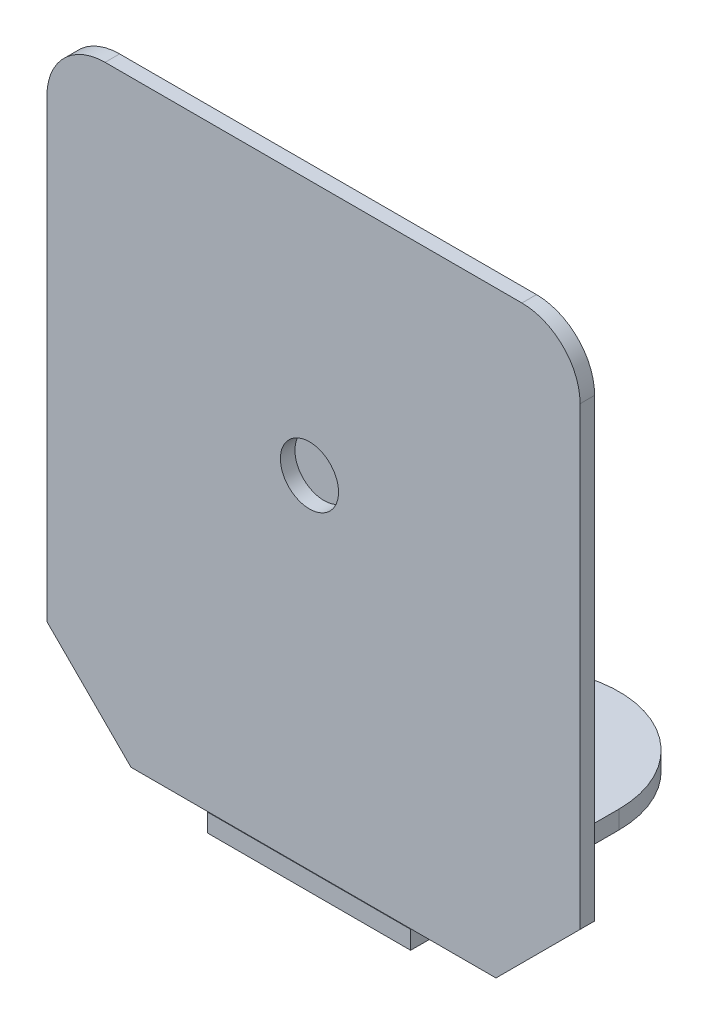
ISO-10303-21;
HEADER;
FILE_DESCRIPTION(('STEP AP214'),'2;1');
FILE_NAME('part.step','',(''),(''),'','','');
FILE_SCHEMA(('AUTOMOTIVE_DESIGN { 1 0 10303 214 1 1 1 1 }'));
ENDSEC;
DATA;
#1=APPLICATION_CONTEXT('core data for automotive mechanical design processes');
#2=APPLICATION_PROTOCOL_DEFINITION('international standard','automotive_design',2000,#1);
#3=PRODUCT_CONTEXT('',#1,'mechanical');
#4=PRODUCT('Part','Part','',(#3));
#5=PRODUCT_RELATED_PRODUCT_CATEGORY('part','',(#4));
#6=PRODUCT_DEFINITION_FORMATION('','',#4);
#7=PRODUCT_DEFINITION_CONTEXT('part definition',#1,'design');
#8=PRODUCT_DEFINITION('design','',#6,#7);
#9=PRODUCT_DEFINITION_SHAPE('','',#8);
#10=(LENGTH_UNIT() NAMED_UNIT(*) SI_UNIT(.MILLI.,.METRE.));
#11=(NAMED_UNIT(*) PLANE_ANGLE_UNIT() SI_UNIT($,.RADIAN.));
#12=(NAMED_UNIT(*) SI_UNIT($,.STERADIAN.) SOLID_ANGLE_UNIT());
#13=UNCERTAINTY_MEASURE_WITH_UNIT(LENGTH_MEASURE(1.E-05),#10,'distance_accuracy_value','');
#14=(GEOMETRIC_REPRESENTATION_CONTEXT(3) GLOBAL_UNCERTAINTY_ASSIGNED_CONTEXT((#13)) GLOBAL_UNIT_ASSIGNED_CONTEXT((#10,
#11,#12)) REPRESENTATION_CONTEXT('',''));
#15=CARTESIAN_POINT('',(0.,0.,0.));
#16=DIRECTION('',(0.,0.,1.));
#17=DIRECTION('',(1.,0.,0.));
#18=AXIS2_PLACEMENT_3D('',#15,#16,#17);
#19=CARTESIAN_POINT('',(3.34575114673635,5.7,0.));
#20=DIRECTION('',(0.,0.,-1.));
#21=DIRECTION('',(-1.,0.,0.));
#22=AXIS2_PLACEMENT_3D('',#19,#20,#21);
#23=PLANE('',#22);
#24=DIRECTION('',(1.,0.,0.));
#25=VECTOR('',#24,1.);
#26=CARTESIAN_POINT('',(8.72284317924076,-1.71953510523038,0.));
#27=LINE('',#26,#25);
#28=CARTESIAN_POINT('',(3.70275192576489,-1.71953510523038,0.));
#29=VERTEX_POINT('',#28);
#30=CARTESIAN_POINT('',(4.75844340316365,-1.71953510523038,0.));
#31=VERTEX_POINT('',#30);
#32=EDGE_CURVE('E186',#29,#31,#27,.T.);
#33=ORIENTED_EDGE('',*,*,#32,.F.);
#34=DIRECTION('',(0.707106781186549,-0.707106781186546,0.));
#35=VECTOR('',#34,1.);
#36=CARTESIAN_POINT('',(3.70275192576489,-1.71953510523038,0.));
#37=LINE('',#36,#35);
#38=CARTESIAN_POINT('',(2.54575114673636,-0.562534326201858,0.));
#39=VERTEX_POINT('',#38);
#40=EDGE_CURVE('E201',#39,#29,#37,.T.);
#41=ORIENTED_EDGE('',*,*,#40,.F.);
#42=DIRECTION('',(0.,-1.,0.));
#43=VECTOR('',#42,1.);
#44=CARTESIAN_POINT('',(2.54575114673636,-0.562534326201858,0.));
#45=LINE('',#44,#43);
#46=CARTESIAN_POINT('',(2.54575114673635,5.69999999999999,0.));
#47=VERTEX_POINT('',#46);
#48=EDGE_CURVE('E199',#47,#39,#45,.T.);
#49=ORIENTED_EDGE('',*,*,#48,.F.);
#50=CARTESIAN_POINT('',(3.34575114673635,5.7,0.));
#51=DIRECTION('',(0.,0.,1.));
#52=DIRECTION('',(-1.,0.,0.));
#53=AXIS2_PLACEMENT_3D('',#50,#51,#52);
#54=CIRCLE('',#53,0.8);
#55=CARTESIAN_POINT('',(3.34575114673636,6.5,0.));
#56=VERTEX_POINT('',#55);
#57=EDGE_CURVE('E196',#56,#47,#54,.T.);
#58=ORIENTED_EDGE('',*,*,#57,.F.);
#59=DIRECTION('',(-1.,0.,0.));
#60=VECTOR('',#59,1.);
#61=CARTESIAN_POINT('',(9.07984395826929,6.5,0.));
#62=LINE('',#61,#60);
#63=CARTESIAN_POINT('',(9.07984395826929,6.5,0.));
#64=VERTEX_POINT('',#63);
#65=EDGE_CURVE('E194',#64,#56,#62,.T.);
#66=ORIENTED_EDGE('',*,*,#65,.F.);
#67=CARTESIAN_POINT('',(9.07984395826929,5.7,0.));
#68=DIRECTION('',(0.,0.,1.));
#69=DIRECTION('',(1.,0.,0.));
#70=AXIS2_PLACEMENT_3D('',#67,#68,#69);
#71=CIRCLE('',#70,0.800000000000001);
#72=CARTESIAN_POINT('',(9.87984395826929,5.7,0.));
#73=VERTEX_POINT('',#72);
#74=EDGE_CURVE('E192',#73,#64,#71,.T.);
#75=ORIENTED_EDGE('',*,*,#74,.F.);
#76=DIRECTION('',(0.,1.,0.));
#77=VECTOR('',#76,1.);
#78=CARTESIAN_POINT('',(9.87984395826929,-0.562534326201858,0.));
#79=LINE('',#78,#77);
#80=CARTESIAN_POINT('',(9.87984395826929,-0.562534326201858,0.));
#81=VERTEX_POINT('',#80);
#82=EDGE_CURVE('E190',#81,#73,#79,.T.);
#83=ORIENTED_EDGE('',*,*,#82,.F.);
#84=DIRECTION('',(0.707106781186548,0.707106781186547,0.));
#85=VECTOR('',#84,1.);
#86=CARTESIAN_POINT('',(9.87984395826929,-0.562534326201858,0.));
#87=LINE('',#86,#85);
#88=CARTESIAN_POINT('',(8.72284317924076,-1.71953510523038,0.));
#89=VERTEX_POINT('',#88);
#90=EDGE_CURVE('E188',#89,#81,#87,.T.);
#91=ORIENTED_EDGE('',*,*,#90,.F.);
#92=CARTESIAN_POINT('',(7.55616000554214,-1.71953510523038,0.));
#93=VERTEX_POINT('',#92);
#94=EDGE_CURVE('E185',#93,#89,#27,.T.);
#95=ORIENTED_EDGE('',*,*,#94,.F.);
#96=EDGE_CURVE('E138',#31,#93,#27,.T.);
#97=ORIENTED_EDGE('',*,*,#96,.F.);
#98=EDGE_LOOP('',(#33,#41,#49,#58,#66,#75,#83,#91,#95,#97));
#99=FACE_BOUND('',#98,.T.);
#100=CARTESIAN_POINT('',(6.1948880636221,3.0084637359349,0.));
#101=DIRECTION('',(0.,0.,-1.));
#102=DIRECTION('',(-1.,0.,0.));
#103=AXIS2_PLACEMENT_3D('',#100,#101,#102);
#104=CIRCLE('',#103,1.72898469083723);
#105=CARTESIAN_POINT('',(4.46590337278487,3.0084637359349,0.));
#106=VERTEX_POINT('',#105);
#107=EDGE_CURVE('E161',#106,#106,#104,.T.);
#108=ORIENTED_EDGE('',*,*,#107,.F.);
#109=EDGE_LOOP('',(#108));
#110=FACE_BOUND('',#109,.T.);
#111=ADVANCED_FACE('F26',(#99,#110),#23,.T.);
#112=CARTESIAN_POINT('',(8.72284317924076,-1.71953510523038,0.2));
#113=DIRECTION('',(0.,1.,0.));
#114=DIRECTION('',(-1.,0.,0.));
#115=AXIS2_PLACEMENT_3D('',#112,#113,#114);
#116=PLANE('',#115);
#117=DIRECTION('',(0.,0.,-1.));
#118=VECTOR('',#117,1.);
#119=CARTESIAN_POINT('',(4.75844340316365,-1.71953510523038,0.207047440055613));
#120=LINE('',#119,#118);
#121=CARTESIAN_POINT('',(4.75844340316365,-1.71953510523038,0.2));
#122=VERTEX_POINT('',#121);
#123=EDGE_CURVE('E11',#122,#31,#120,.T.);
#124=ORIENTED_EDGE('',*,*,#123,.F.);
#125=DIRECTION('',(1.,0.,0.));
#126=VECTOR('',#125,1.);
#127=CARTESIAN_POINT('',(8.72284317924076,-1.71953510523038,0.2));
#128=LINE('',#127,#126);
#129=CARTESIAN_POINT('',(3.70275192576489,-1.71953510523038,0.2));
#130=VERTEX_POINT('',#129);
#131=EDGE_CURVE('E204',#130,#122,#128,.T.);
#132=ORIENTED_EDGE('',*,*,#131,.F.);
#133=DIRECTION('',(0.,0.,-1.));
#134=VECTOR('',#133,1.);
#135=CARTESIAN_POINT('',(3.70275192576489,-1.71953510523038,0.2));
#136=LINE('',#135,#134);
#137=EDGE_CURVE('E221',#130,#29,#136,.T.);
#138=ORIENTED_EDGE('',*,*,#137,.T.);
#139=ORIENTED_EDGE('',*,*,#32,.T.);
#140=EDGE_LOOP('',(#124,#132,#138,#139));
#141=FACE_BOUND('',#140,.T.);
#142=ADVANCED_FACE('F28',(#141),#116,.F.);
#143=DIRECTION('',(0.,0.,1.));
#144=VECTOR('',#143,1.);
#145=CARTESIAN_POINT('',(7.55616000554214,-1.71953510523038,0.207047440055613));
#146=LINE('',#145,#144);
#147=CARTESIAN_POINT('',(7.55616000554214,-1.71953510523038,0.2));
#148=VERTEX_POINT('',#147);
#149=EDGE_CURVE('E35',#93,#148,#146,.T.);
#150=ORIENTED_EDGE('',*,*,#149,.F.);
#151=ORIENTED_EDGE('',*,*,#94,.T.);
#152=DIRECTION('',(0.,0.,-1.));
#153=VECTOR('',#152,1.);
#154=CARTESIAN_POINT('',(8.72284317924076,-1.71953510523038,0.2));
#155=LINE('',#154,#153);
#156=CARTESIAN_POINT('',(8.72284317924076,-1.71953510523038,0.2));
#157=VERTEX_POINT('',#156);
#158=EDGE_CURVE('E30',#157,#89,#155,.T.);
#159=ORIENTED_EDGE('',*,*,#158,.F.);
#160=EDGE_CURVE('E203',#148,#157,#128,.T.);
#161=ORIENTED_EDGE('',*,*,#160,.F.);
#162=EDGE_LOOP('',(#150,#151,#159,#161));
#163=FACE_BOUND('',#162,.T.);
#164=ADVANCED_FACE('F279',(#163),#116,.F.);
#165=CARTESIAN_POINT('',(3.34575114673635,5.7,0.2));
#166=DIRECTION('',(0.,0.,-1.));
#167=DIRECTION('',(-1.,0.,0.));
#168=AXIS2_PLACEMENT_3D('',#165,#166,#167);
#169=PLANE('',#168);
#170=ORIENTED_EDGE('',*,*,#131,.T.);
#171=EDGE_CURVE('E207',#122,#148,#128,.T.);
#172=ORIENTED_EDGE('',*,*,#171,.T.);
#173=ORIENTED_EDGE('',*,*,#160,.T.);
#174=DIRECTION('',(0.707106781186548,0.707106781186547,0.));
#175=VECTOR('',#174,1.);
#176=CARTESIAN_POINT('',(9.87984395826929,-0.562534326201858,0.2));
#177=LINE('',#176,#175);
#178=CARTESIAN_POINT('',(9.87984395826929,-0.562534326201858,0.2));
#179=VERTEX_POINT('',#178);
#180=EDGE_CURVE('E206',#157,#179,#177,.T.);
#181=ORIENTED_EDGE('',*,*,#180,.T.);
#182=DIRECTION('',(0.,1.,0.));
#183=VECTOR('',#182,1.);
#184=CARTESIAN_POINT('',(9.87984395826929,-0.562534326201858,0.2));
#185=LINE('',#184,#183);
#186=CARTESIAN_POINT('',(9.87984395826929,5.7,0.2));
#187=VERTEX_POINT('',#186);
#188=EDGE_CURVE('E209',#179,#187,#185,.T.);
#189=ORIENTED_EDGE('',*,*,#188,.T.);
#190=CARTESIAN_POINT('',(9.07984395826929,5.7,0.2));
#191=DIRECTION('',(0.,0.,1.));
#192=DIRECTION('',(1.,0.,0.));
#193=AXIS2_PLACEMENT_3D('',#190,#191,#192);
#194=CIRCLE('',#193,0.800000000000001);
#195=CARTESIAN_POINT('',(9.07984395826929,6.5,0.2));
#196=VERTEX_POINT('',#195);
#197=EDGE_CURVE('E211',#187,#196,#194,.T.);
#198=ORIENTED_EDGE('',*,*,#197,.T.);
#199=DIRECTION('',(-1.,0.,0.));
#200=VECTOR('',#199,1.);
#201=CARTESIAN_POINT('',(9.07984395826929,6.5,0.2));
#202=LINE('',#201,#200);
#203=CARTESIAN_POINT('',(3.34575114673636,6.5,0.2));
#204=VERTEX_POINT('',#203);
#205=EDGE_CURVE('E213',#196,#204,#202,.T.);
#206=ORIENTED_EDGE('',*,*,#205,.T.);
#207=CARTESIAN_POINT('',(3.34575114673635,5.7,0.2));
#208=DIRECTION('',(0.,0.,1.));
#209=DIRECTION('',(-1.,0.,0.));
#210=AXIS2_PLACEMENT_3D('',#207,#208,#209);
#211=CIRCLE('',#210,0.8);
#212=CARTESIAN_POINT('',(2.54575114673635,5.69999999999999,0.2));
#213=VERTEX_POINT('',#212);
#214=EDGE_CURVE('E215',#204,#213,#211,.T.);
#215=ORIENTED_EDGE('',*,*,#214,.T.);
#216=DIRECTION('',(0.,-1.,0.));
#217=VECTOR('',#216,1.);
#218=CARTESIAN_POINT('',(2.54575114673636,0.,0.2));
#219=LINE('',#218,#217);
#220=CARTESIAN_POINT('',(2.54575114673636,-0.562534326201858,0.2));
#221=VERTEX_POINT('',#220);
#222=EDGE_CURVE('E217',#213,#221,#219,.T.);
#223=ORIENTED_EDGE('',*,*,#222,.T.);
#224=DIRECTION('',(0.707106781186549,-0.707106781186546,0.));
#225=VECTOR('',#224,1.);
#226=CARTESIAN_POINT('',(3.70275192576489,-1.71953510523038,0.2));
#227=LINE('',#226,#225);
#228=EDGE_CURVE('E219',#221,#130,#227,.T.);
#229=ORIENTED_EDGE('',*,*,#228,.T.);
#230=EDGE_LOOP('',(#170,#172,#173,#181,#189,#198,#206,#215,#223,#229));
#231=FACE_BOUND('',#230,.T.);
#232=CARTESIAN_POINT('',(6.1573017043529,2.98516921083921,0.2));
#233=DIRECTION('',(0.,0.,1.));
#234=DIRECTION('',(1.,0.,0.));
#235=AXIS2_PLACEMENT_3D('',#232,#233,#234);
#236=CIRCLE('',#235,0.400000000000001);
#237=CARTESIAN_POINT('',(6.5573017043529,2.98516921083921,0.2));
#238=VERTEX_POINT('',#237);
#239=EDGE_CURVE('E182',#238,#238,#236,.T.);
#240=ORIENTED_EDGE('',*,*,#239,.F.);
#241=EDGE_LOOP('',(#240));
#242=FACE_BOUND('',#241,.T.);
#243=ADVANCED_FACE('F286',(#231,#242),#169,.F.);
#244=CARTESIAN_POINT('',(9.87984395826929,-0.562534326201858,0.2));
#245=DIRECTION('',(-0.707106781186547,0.707106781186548,0.));
#246=DIRECTION('',(-0.707106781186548,-0.707106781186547,0.));
#247=AXIS2_PLACEMENT_3D('',#244,#245,#246);
#248=PLANE('',#247);
#249=ORIENTED_EDGE('',*,*,#90,.T.);
#250=DIRECTION('',(0.,0.,-1.));
#251=VECTOR('',#250,1.);
#252=CARTESIAN_POINT('',(9.87984395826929,-0.562534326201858,0.2));
#253=LINE('',#252,#251);
#254=EDGE_CURVE('E238',#179,#81,#253,.T.);
#255=ORIENTED_EDGE('',*,*,#254,.F.);
#256=ORIENTED_EDGE('',*,*,#180,.F.);
#257=ORIENTED_EDGE('',*,*,#158,.T.);
#258=EDGE_LOOP('',(#249,#255,#256,#257));
#259=FACE_BOUND('',#258,.T.);
#260=ADVANCED_FACE('F289',(#259),#248,.F.);
#261=CARTESIAN_POINT('',(9.87984395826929,-0.562534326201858,0.2));
#262=DIRECTION('',(-1.,0.,0.));
#263=DIRECTION('',(0.,-1.,0.));
#264=AXIS2_PLACEMENT_3D('',#261,#262,#263);
#265=PLANE('',#264);
#266=ORIENTED_EDGE('',*,*,#82,.T.);
#267=DIRECTION('',(0.,0.,-1.));
#268=VECTOR('',#267,1.);
#269=CARTESIAN_POINT('',(9.87984395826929,5.7,0.2));
#270=LINE('',#269,#268);
#271=EDGE_CURVE('E236',#187,#73,#270,.T.);
#272=ORIENTED_EDGE('',*,*,#271,.F.);
#273=ORIENTED_EDGE('',*,*,#188,.F.);
#274=ORIENTED_EDGE('',*,*,#254,.T.);
#275=EDGE_LOOP('',(#266,#272,#273,#274));
#276=FACE_BOUND('',#275,.T.);
#277=ADVANCED_FACE('F310',(#276),#265,.F.);
#278=CARTESIAN_POINT('',(9.07984395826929,5.7,0.2));
#279=DIRECTION('',(0.,0.,-1.));
#280=DIRECTION('',(-1.,0.,0.));
#281=AXIS2_PLACEMENT_3D('',#278,#279,#280);
#282=CYLINDRICAL_SURFACE('',#281,0.800000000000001);
#283=ORIENTED_EDGE('',*,*,#74,.T.);
#284=DIRECTION('',(0.,0.,-1.));
#285=VECTOR('',#284,1.);
#286=CARTESIAN_POINT('',(9.07984395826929,6.5,0.2));
#287=LINE('',#286,#285);
#288=EDGE_CURVE('E233',#196,#64,#287,.T.);
#289=ORIENTED_EDGE('',*,*,#288,.F.);
#290=ORIENTED_EDGE('',*,*,#197,.F.);
#291=ORIENTED_EDGE('',*,*,#271,.T.);
#292=EDGE_LOOP('',(#283,#289,#290,#291));
#293=FACE_BOUND('',#292,.T.);
#294=ADVANCED_FACE('F306',(#293),#282,.T.);
#295=CARTESIAN_POINT('',(9.07984395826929,6.5,0.2));
#296=DIRECTION('',(0.,-1.,0.));
#297=DIRECTION('',(0.,0.,-1.));
#298=AXIS2_PLACEMENT_3D('',#295,#296,#297);
#299=PLANE('',#298);
#300=ORIENTED_EDGE('',*,*,#65,.T.);
#301=DIRECTION('',(0.,0.,-1.));
#302=VECTOR('',#301,1.);
#303=CARTESIAN_POINT('',(3.34575114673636,6.5,0.2));
#304=LINE('',#303,#302);
#305=EDGE_CURVE('E230',#204,#56,#304,.T.);
#306=ORIENTED_EDGE('',*,*,#305,.F.);
#307=ORIENTED_EDGE('',*,*,#205,.F.);
#308=ORIENTED_EDGE('',*,*,#288,.T.);
#309=EDGE_LOOP('',(#300,#306,#307,#308));
#310=FACE_BOUND('',#309,.T.);
#311=ADVANCED_FACE('F302',(#310),#299,.F.);
#312=CARTESIAN_POINT('',(3.34575114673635,5.7,0.2));
#313=DIRECTION('',(0.,0.,-1.));
#314=DIRECTION('',(-1.,0.,0.));
#315=AXIS2_PLACEMENT_3D('',#312,#313,#314);
#316=CYLINDRICAL_SURFACE('',#315,0.8);
#317=ORIENTED_EDGE('',*,*,#57,.T.);
#318=DIRECTION('',(0.,0.,-1.));
#319=VECTOR('',#318,1.);
#320=CARTESIAN_POINT('',(2.54575114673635,5.69999999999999,0.2));
#321=LINE('',#320,#319);
#322=EDGE_CURVE('E227',#213,#47,#321,.T.);
#323=ORIENTED_EDGE('',*,*,#322,.F.);
#324=ORIENTED_EDGE('',*,*,#214,.F.);
#325=ORIENTED_EDGE('',*,*,#305,.T.);
#326=EDGE_LOOP('',(#317,#323,#324,#325));
#327=FACE_BOUND('',#326,.T.);
#328=ADVANCED_FACE('F298',(#327),#316,.T.);
#329=CARTESIAN_POINT('',(2.54575114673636,-0.562534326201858,0.2));
#330=DIRECTION('',(1.,0.,0.));
#331=DIRECTION('',(0.,0.,-1.));
#332=AXIS2_PLACEMENT_3D('',#329,#330,#331);
#333=PLANE('',#332);
#334=ORIENTED_EDGE('',*,*,#48,.T.);
#335=DIRECTION('',(0.,0.,-1.));
#336=VECTOR('',#335,1.);
#337=CARTESIAN_POINT('',(2.54575114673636,-0.562534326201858,0.2));
#338=LINE('',#337,#336);
#339=EDGE_CURVE('E224',#221,#39,#338,.T.);
#340=ORIENTED_EDGE('',*,*,#339,.F.);
#341=ORIENTED_EDGE('',*,*,#222,.F.);
#342=ORIENTED_EDGE('',*,*,#322,.T.);
#343=EDGE_LOOP('',(#334,#340,#341,#342));
#344=FACE_BOUND('',#343,.T.);
#345=ADVANCED_FACE('F294',(#344),#333,.F.);
#346=CARTESIAN_POINT('',(3.70275192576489,-1.71953510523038,0.2));
#347=DIRECTION('',(0.707106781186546,0.707106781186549,0.));
#348=DIRECTION('',(-0.707106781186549,0.707106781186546,0.));
#349=AXIS2_PLACEMENT_3D('',#346,#347,#348);
#350=PLANE('',#349);
#351=ORIENTED_EDGE('',*,*,#40,.T.);
#352=ORIENTED_EDGE('',*,*,#137,.F.);
#353=ORIENTED_EDGE('',*,*,#228,.F.);
#354=ORIENTED_EDGE('',*,*,#339,.T.);
#355=EDGE_LOOP('',(#351,#352,#353,#354));
#356=FACE_BOUND('',#355,.T.);
#357=ADVANCED_FACE('F291',(#356),#350,.F.);
#358=CARTESIAN_POINT('',(6.1573017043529,2.98516921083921,0.2));
#359=DIRECTION('',(0.,0.,-1.));
#360=DIRECTION('',(-1.,0.,0.));
#361=AXIS2_PLACEMENT_3D('',#358,#359,#360);
#362=CYLINDRICAL_SURFACE('',#361,0.400000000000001);
#363=ORIENTED_EDGE('',*,*,#239,.T.);
#364=EDGE_LOOP('',(#363));
#365=FACE_BOUND('',#364,.T.);
#366=CARTESIAN_POINT('',(6.1573017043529,2.98516921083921,0.));
#367=DIRECTION('',(0.,0.,1.));
#368=DIRECTION('',(1.,0.,0.));
#369=AXIS2_PLACEMENT_3D('',#366,#367,#368);
#370=CIRCLE('',#369,0.400000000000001);
#371=CARTESIAN_POINT('',(6.5573017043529,2.98516921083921,0.));
#372=VERTEX_POINT('',#371);
#373=EDGE_CURVE('E151',#372,#372,#370,.T.);
#374=ORIENTED_EDGE('',*,*,#373,.F.);
#375=EDGE_LOOP('',(#374));
#376=FACE_BOUND('',#375,.T.);
#377=ADVANCED_FACE('F284',(#365,#376),#362,.F.);
#378=CARTESIAN_POINT('',(6.1573017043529,-1.71953510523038,-2.65923669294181));
#379=DIRECTION('',(0.,1.,0.));
#380=DIRECTION('',(-1.,0.,0.));
#381=AXIS2_PLACEMENT_3D('',#378,#379,#380);
#382=PLANE('',#381);
#383=ORIENTED_EDGE('',*,*,#171,.F.);
#384=CARTESIAN_POINT('',(4.75844340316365,-1.71953510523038,0.207047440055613));
#385=VERTEX_POINT('',#384);
#386=EDGE_CURVE('E37',#385,#122,#120,.T.);
#387=ORIENTED_EDGE('',*,*,#386,.F.);
#388=DIRECTION('',(-1.,0.,0.));
#389=VECTOR('',#388,1.);
#390=CARTESIAN_POINT('',(4.75844340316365,-1.71953510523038,0.207047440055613));
#391=LINE('',#390,#389);
#392=CARTESIAN_POINT('',(7.55616000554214,-1.71953510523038,0.207047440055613));
#393=VERTEX_POINT('',#392);
#394=EDGE_CURVE('E140',#393,#385,#391,.T.);
#395=ORIENTED_EDGE('',*,*,#394,.F.);
#396=EDGE_CURVE('E141',#148,#393,#146,.T.);
#397=ORIENTED_EDGE('',*,*,#396,.F.);
#398=EDGE_LOOP('',(#383,#387,#395,#397));
#399=FACE_BOUND('',#398,.T.);
#400=ADVANCED_FACE('F257',(#399),#382,.T.);
#401=CARTESIAN_POINT('',(6.1573017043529,-1.96953510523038,-2.65923669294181));
#402=DIRECTION('',(0.,1.,0.));
#403=DIRECTION('',(-1.,0.,0.));
#404=AXIS2_PLACEMENT_3D('',#401,#402,#403);
#405=CYLINDRICAL_SURFACE('',#404,1.39885830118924);
#406=CARTESIAN_POINT('',(6.1573017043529,-1.71953510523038,-2.65923669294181));
#407=DIRECTION('',(0.,-1.,0.));
#408=DIRECTION('',(-1.,0.,0.));
#409=AXIS2_PLACEMENT_3D('',#406,#407,#408);
#410=CIRCLE('',#409,1.39885830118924);
#411=CARTESIAN_POINT('',(4.75844340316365,-1.71953510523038,-2.65923669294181));
#412=VERTEX_POINT('',#411);
#413=CARTESIAN_POINT('',(7.55616000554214,-1.71953510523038,-2.65923669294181));
#414=VERTEX_POINT('',#413);
#415=EDGE_CURVE('E137',#412,#414,#410,.T.);
#416=ORIENTED_EDGE('',*,*,#415,.T.);
#417=DIRECTION('',(0.,1.,0.));
#418=VECTOR('',#417,1.);
#419=CARTESIAN_POINT('',(7.55616000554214,-1.96953510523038,-2.65923669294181));
#420=LINE('',#419,#418);
#421=CARTESIAN_POINT('',(7.55616000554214,-1.96953510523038,-2.65923669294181));
#422=VERTEX_POINT('',#421);
#423=EDGE_CURVE('E144',#422,#414,#420,.T.);
#424=ORIENTED_EDGE('',*,*,#423,.F.);
#425=CARTESIAN_POINT('',(6.1573017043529,-1.96953510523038,-2.65923669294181));
#426=DIRECTION('',(0.,-1.,0.));
#427=DIRECTION('',(-1.,0.,0.));
#428=AXIS2_PLACEMENT_3D('',#425,#426,#427);
#429=CIRCLE('',#428,1.39885830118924);
#430=CARTESIAN_POINT('',(4.75844340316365,-1.96953510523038,-2.65923669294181));
#431=VERTEX_POINT('',#430);
#432=EDGE_CURVE('E167',#431,#422,#429,.T.);
#433=ORIENTED_EDGE('',*,*,#432,.F.);
#434=DIRECTION('',(0.,1.,0.));
#435=VECTOR('',#434,1.);
#436=CARTESIAN_POINT('',(4.75844340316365,-1.96953510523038,-2.65923669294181));
#437=LINE('',#436,#435);
#438=EDGE_CURVE('E157',#431,#412,#437,.T.);
#439=ORIENTED_EDGE('',*,*,#438,.T.);
#440=EDGE_LOOP('',(#416,#424,#433,#439));
#441=FACE_BOUND('',#440,.T.);
#442=ADVANCED_FACE('F155',(#441),#405,.T.);
#443=CARTESIAN_POINT('',(7.55616000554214,-1.96953510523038,0.207047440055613));
#444=DIRECTION('',(-1.,0.,0.));
#445=DIRECTION('',(0.,0.,1.));
#446=AXIS2_PLACEMENT_3D('',#443,#444,#445);
#447=PLANE('',#446);
#448=EDGE_CURVE('E132',#414,#93,#146,.T.);
#449=ORIENTED_EDGE('',*,*,#448,.T.);
#450=ORIENTED_EDGE('',*,*,#149,.T.);
#451=ORIENTED_EDGE('',*,*,#396,.T.);
#452=DIRECTION('',(0.,1.,0.));
#453=VECTOR('',#452,1.);
#454=CARTESIAN_POINT('',(7.55616000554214,-1.96953510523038,0.207047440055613));
#455=LINE('',#454,#453);
#456=CARTESIAN_POINT('',(7.55616000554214,-1.96953510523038,0.207047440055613));
#457=VERTEX_POINT('',#456);
#458=EDGE_CURVE('E152',#457,#393,#455,.T.);
#459=ORIENTED_EDGE('',*,*,#458,.F.);
#460=DIRECTION('',(0.,0.,1.));
#461=VECTOR('',#460,1.);
#462=CARTESIAN_POINT('',(7.55616000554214,-1.96953510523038,0.207047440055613));
#463=LINE('',#462,#461);
#464=EDGE_CURVE('E147',#422,#457,#463,.T.);
#465=ORIENTED_EDGE('',*,*,#464,.F.);
#466=ORIENTED_EDGE('',*,*,#423,.T.);
#467=EDGE_LOOP('',(#449,#450,#451,#459,#465,#466));
#468=FACE_BOUND('',#467,.T.);
#469=ADVANCED_FACE('F145',(#468),#447,.F.);
#470=CARTESIAN_POINT('',(4.75844340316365,-1.96953510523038,0.207047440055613));
#471=DIRECTION('',(0.,0.,-1.));
#472=DIRECTION('',(-1.,0.,0.));
#473=AXIS2_PLACEMENT_3D('',#470,#471,#472);
#474=PLANE('',#473);
#475=ORIENTED_EDGE('',*,*,#394,.T.);
#476=DIRECTION('',(0.,1.,0.));
#477=VECTOR('',#476,1.);
#478=CARTESIAN_POINT('',(4.75844340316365,-1.96953510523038,0.207047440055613));
#479=LINE('',#478,#477);
#480=CARTESIAN_POINT('',(4.75844340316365,-1.96953510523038,0.207047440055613));
#481=VERTEX_POINT('',#480);
#482=EDGE_CURVE('E175',#481,#385,#479,.T.);
#483=ORIENTED_EDGE('',*,*,#482,.F.);
#484=DIRECTION('',(-1.,0.,0.));
#485=VECTOR('',#484,1.);
#486=CARTESIAN_POINT('',(4.75844340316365,-1.96953510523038,0.207047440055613));
#487=LINE('',#486,#485);
#488=EDGE_CURVE('E170',#457,#481,#487,.T.);
#489=ORIENTED_EDGE('',*,*,#488,.F.);
#490=ORIENTED_EDGE('',*,*,#458,.T.);
#491=EDGE_LOOP('',(#475,#483,#489,#490));
#492=FACE_BOUND('',#491,.T.);
#493=ADVANCED_FACE('F254',(#492),#474,.F.);
#494=CARTESIAN_POINT('',(4.75844340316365,-1.96953510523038,0.207047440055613));
#495=DIRECTION('',(1.,0.,0.));
#496=DIRECTION('',(0.,0.,-1.));
#497=AXIS2_PLACEMENT_3D('',#494,#495,#496);
#498=PLANE('',#497);
#499=ORIENTED_EDGE('',*,*,#386,.T.);
#500=ORIENTED_EDGE('',*,*,#123,.T.);
#501=EDGE_CURVE('E38',#31,#412,#120,.T.);
#502=ORIENTED_EDGE('',*,*,#501,.T.);
#503=ORIENTED_EDGE('',*,*,#438,.F.);
#504=DIRECTION('',(0.,0.,-1.));
#505=VECTOR('',#504,1.);
#506=CARTESIAN_POINT('',(4.75844340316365,-1.96953510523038,0.207047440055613));
#507=LINE('',#506,#505);
#508=EDGE_CURVE('E172',#481,#431,#507,.T.);
#509=ORIENTED_EDGE('',*,*,#508,.F.);
#510=ORIENTED_EDGE('',*,*,#482,.T.);
#511=EDGE_LOOP('',(#499,#500,#502,#503,#509,#510));
#512=FACE_BOUND('',#511,.T.);
#513=ADVANCED_FACE('F259',(#512),#498,.F.);
#514=CARTESIAN_POINT('',(6.1573017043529,-1.96953510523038,-2.65923669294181));
#515=DIRECTION('',(0.,1.,0.));
#516=DIRECTION('',(-1.,0.,0.));
#517=AXIS2_PLACEMENT_3D('',#514,#515,#516);
#518=PLANE('',#517);
#519=ORIENTED_EDGE('',*,*,#432,.T.);
#520=ORIENTED_EDGE('',*,*,#464,.T.);
#521=ORIENTED_EDGE('',*,*,#488,.T.);
#522=ORIENTED_EDGE('',*,*,#508,.T.);
#523=EDGE_LOOP('',(#519,#520,#521,#522));
#524=FACE_BOUND('',#523,.T.);
#525=ADVANCED_FACE('F262',(#524),#518,.F.);
#526=ORIENTED_EDGE('',*,*,#501,.F.);
#527=ORIENTED_EDGE('',*,*,#96,.T.);
#528=ORIENTED_EDGE('',*,*,#448,.F.);
#529=ORIENTED_EDGE('',*,*,#415,.F.);
#530=EDGE_LOOP('',(#526,#527,#528,#529));
#531=FACE_BOUND('',#530,.T.);
#532=ADVANCED_FACE('F135',(#531),#382,.T.);
#533=CARTESIAN_POINT('',(6.1948880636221,3.0084637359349,0.));
#534=DIRECTION('',(0.,0.,-1.));
#535=DIRECTION('',(-1.,0.,0.));
#536=AXIS2_PLACEMENT_3D('',#533,#534,#535);
#537=PLANE('',#536);
#538=ORIENTED_EDGE('',*,*,#373,.T.);
#539=EDGE_LOOP('',(#538));
#540=FACE_BOUND('',#539,.T.);
#541=ADVANCED_FACE('F269',(#540),#537,.F.);
#542=CARTESIAN_POINT('',(6.1948880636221,3.0084637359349,0.));
#543=DIRECTION('',(0.,0.,1.));
#544=DIRECTION('',(-1.,0.,0.));
#545=AXIS2_PLACEMENT_3D('',#542,#543,#544);
#546=CONICAL_SURFACE('',#545,1.72898469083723,0.78539816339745);
#547=CARTESIAN_POINT('',(6.1948880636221,3.0084637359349,-0.4));
#548=DIRECTION('',(0.,0.,-1.));
#549=DIRECTION('',(-1.,0.,0.));
#550=AXIS2_PLACEMENT_3D('',#547,#548,#549);
#551=CIRCLE('',#550,1.32898469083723);
#552=CARTESIAN_POINT('',(4.86590337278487,3.0084637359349,-0.4));
#553=VERTEX_POINT('',#552);
#554=EDGE_CURVE('E158',#553,#553,#551,.T.);
#555=ORIENTED_EDGE('',*,*,#554,.F.);
#556=EDGE_LOOP('',(#555));
#557=FACE_BOUND('',#556,.T.);
#558=ORIENTED_EDGE('',*,*,#107,.T.);
#559=EDGE_LOOP('',(#558));
#560=FACE_BOUND('',#559,.T.);
#561=ADVANCED_FACE('F384',(#557,#560),#546,.T.);
#562=CARTESIAN_POINT('',(6.1948880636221,3.0084637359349,-0.4));
#563=DIRECTION('',(0.,0.,-1.));
#564=DIRECTION('',(-1.,0.,0.));
#565=AXIS2_PLACEMENT_3D('',#562,#563,#564);
#566=PLANE('',#565);
#567=ORIENTED_EDGE('',*,*,#554,.T.);
#568=EDGE_LOOP('',(#567));
#569=FACE_BOUND('',#568,.T.);
#570=ADVANCED_FACE('F392',(#569),#566,.T.);
#571=CLOSED_SHELL('',(#111,#142,#164,#243,#260,#277,#294,#311,#328,#345,#357,#377,#400,#442,
#469,#493,#513,#525,#532,#541,#561,#570));
#572=MANIFOLD_SOLID_BREP('B2',#571);
#573=ADVANCED_BREP_SHAPE_REPRESENTATION('',(#18,#572),#14);
#574=SHAPE_DEFINITION_REPRESENTATION(#9,#573);
ENDSEC;
END-ISO-10303-21;
